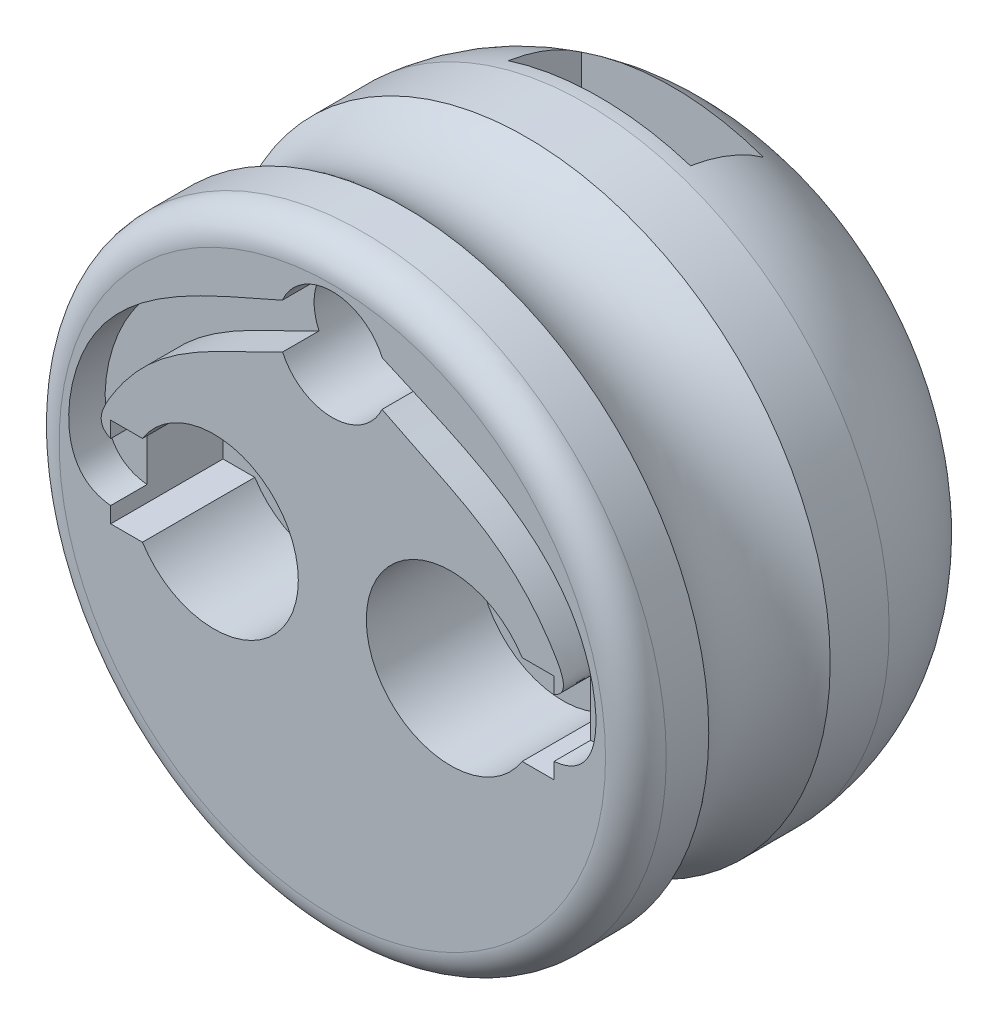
from build123d import *

# Parameters (mm, degrees)
ESQUISSE1_R             = 50
BOSS_EXTRU_1_DEPTH      = 65
CONG_1_R                = 5
ENL_V_MAT_EXTRU_1_DEPTH = 18.5
ENL_V_MAT_EXTRU_2_DEPTH = 6
ESQUISSE6_R             = 9
ENL_V_MAT_EXTRU_3_DEPTH = 56
ESQUISSE7_W             = 30
ESQUISSE7_H             = 12
ENL_V_MAT_EXTRU_4_DEPTH = 32
ESQUISSE8_R             = 28
ENL_V_MAT_EXTRU_5_DEPTH = 42


with BuildPart() as part:
    # Esquisse1 → Boss.-Extru.1 (new body)
    with BuildSketch(Plane.XY):
        Circle(ESQUISSE1_R)
    extrude(amount=BOSS_EXTRU_1_DEPTH)

    # Esquisse2 → Enl_vement de mati_re-R_volution1 (revolve, cut)
    with BuildSketch(Plane(origin=(0, 0, 0), x_dir=(0, 0, -1), z_dir=(1, 0, 0)), mode=Mode.PRIVATE) as enl_vement_de_mati_re_r_volution1_sk:
        with BuildLine():
            Line((0, -35.788256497), (7.582209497, -43.370465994))
            Line((7.582209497, -43.370465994), (-5.179500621, -64.759702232))
            Line((-5.179500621, -64.759702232), (-23.286654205, -50))
            add(Edge.make_bspline(
                [(-23.286654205, -50), (-8.178358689, -48.675832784), (0, -35.788256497)],
                knots=[0, 0, 0, 1, 1, 1], degree=2))
        make_face()
    revolve(enl_vement_de_mati_re_r_volution1_sk.sketch.rotate(Axis((0, 0, 65), (0, 0, -1)), 270), axis=Axis((0, 0, 65), (0, 0, -1)), mode=Mode.SUBTRACT)

    # Esquisse3 → Enl_vement de mati_re-R_volution2 (revolve, cut)
    with BuildSketch(Plane(origin=(0, 0, 0), x_dir=(0, 0, -1), z_dir=(1, 0, 0)), mode=Mode.PRIVATE) as enl_vement_de_mati_re_r_volution2_sk:
        with BuildLine():
            Line((-53, -50), (-53, -60.731918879))
            Line((-53, -60.731918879), (-33, -61.24561385))
            Line((-33, -61.24561385), (-33, -50))
            ThreePointArc((-33, -50), (-43, -46.489993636), (-53, -50))
        make_face()
    revolve(enl_vement_de_mati_re_r_volution2_sk.sketch.rotate(Axis((0, 0, 65), (0, 0, -1)), 270), axis=Axis((0, 0, 65), (0, 0, -1)), mode=Mode.SUBTRACT)

    # Cong_1
    cong_1_edges = [part.edges().sort_by_distance(p)[0] for p in [
        (-50, 0, 65),
    ]]
    fillet(cong_1_edges, radius=CONG_1_R)

    # Esquisse4 → Enl_v. mat.-Extru.1 (cut)
    with BuildSketch(Plane.XY.offset(65)):
        with BuildLine():
            Line((-36.5, 7.4), (-31.266477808, 7.4))
            ThreePointArc((-31.266477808, 7.4), (-5.6, 0), (-31.266477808, -7.4))
            Line((-31.266477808, -7.4), (-36.5, -7.4))
            Line((-36.5, -7.4), (-36.5, 7.4))
        make_face()
        with BuildLine():
            Line((36.5, 7.4), (31.266477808, 7.4))
            ThreePointArc((31.266477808, 7.4), (5.6, 0), (31.266477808, -7.4))
            Line((31.266477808, -7.4), (36.5, -7.4))
            Line((36.5, -7.4), (36.5, 7.4))
        make_face()
    extrude(amount=-ENL_V_MAT_EXTRU_1_DEPTH, mode=Mode.SUBTRACT)

    # Esquisse5 → Enl_v. mat.-Extru.2 (cut)
    with BuildSketch(Plane.XY.offset(65)):
        with BuildLine():
            Line((-36.5, 4.756301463), (-36.5, -4.786728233))
            add(Edge.make_bspline(
                [(-36.5, -4.786728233), (-44.330883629, -4.042394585), (-44.402513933, 28.599018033), (-15.314361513, 34.256860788), (-1.341988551, 42.033761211)],
                knots=[0, 0, 0, 0, 0.272915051, 1, 1, 1, 1], degree=3))
            Line((-1.341988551, 42.033761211), (1.341988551, 42.033761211))
            add(Edge.make_bspline(
                [(36.5, -4.786728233), (44.330883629, -4.042394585), (44.402513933, 28.599018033), (15.314361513, 34.256860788), (1.341988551, 42.033761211)],
                knots=[0, 0, 0, 0, 0.272915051, 1, 1, 1, 1], degree=3))
            Line((36.5, -4.786728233), (36.5, 4.756301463))
            add(Edge.make_bspline(
                [(36.5, 4.756301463), (39.182447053, 5.896156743), (29.739691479, 24.592819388), (16.069951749, 26.023119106), (2.087537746, 34.727379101)],
                knots=[0, 0, 0, 0, 0.137787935, 1, 1, 1, 1], degree=3))
            Line((2.087537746, 34.727379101), (-2.087537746, 34.727379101))
            add(Edge.make_bspline(
                [(-36.5, 4.756301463), (-39.182447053, 5.896156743), (-29.739691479, 24.592819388), (-16.069951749, 26.023119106), (-2.087537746, 34.727379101)],
                knots=[0, 0, 0, 0, 0.137787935, 1, 1, 1, 1], degree=3))
        make_face()
    extrude(amount=-ENL_V_MAT_EXTRU_2_DEPTH, mode=Mode.SUBTRACT)

    # Esquisse6 → Enl_v. mat.-Extru.3 (cut)
    with BuildSketch(Plane.XY.offset(65)):
        with Locations((0, 35)):
            Circle(ESQUISSE6_R)
    extrude(amount=-ENL_V_MAT_EXTRU_3_DEPTH, mode=Mode.SUBTRACT)

    # Esquisse7 → Enl_v. mat.-Extru.4 (cut)
    with BuildSketch(Plane(origin=(0, 57.872394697, 0), x_dir=(1, 0, 0), z_dir=(0, 1, 0))):
        with Locations((0, -15)):
            Rectangle(ESQUISSE7_W, ESQUISSE7_H)
    extrude(amount=-ENL_V_MAT_EXTRU_4_DEPTH, mode=Mode.SUBTRACT)

    # Esquisse8 → Enl_v. mat.-Extru.5 (cut)
    with BuildSketch(Plane(origin=(0, 0, 0), x_dir=(-1, 0, 0), z_dir=(0, 0, -1))):
        Circle(ESQUISSE8_R)
    extrude(amount=-ENL_V_MAT_EXTRU_5_DEPTH, mode=Mode.SUBTRACT)


solid = part.part
